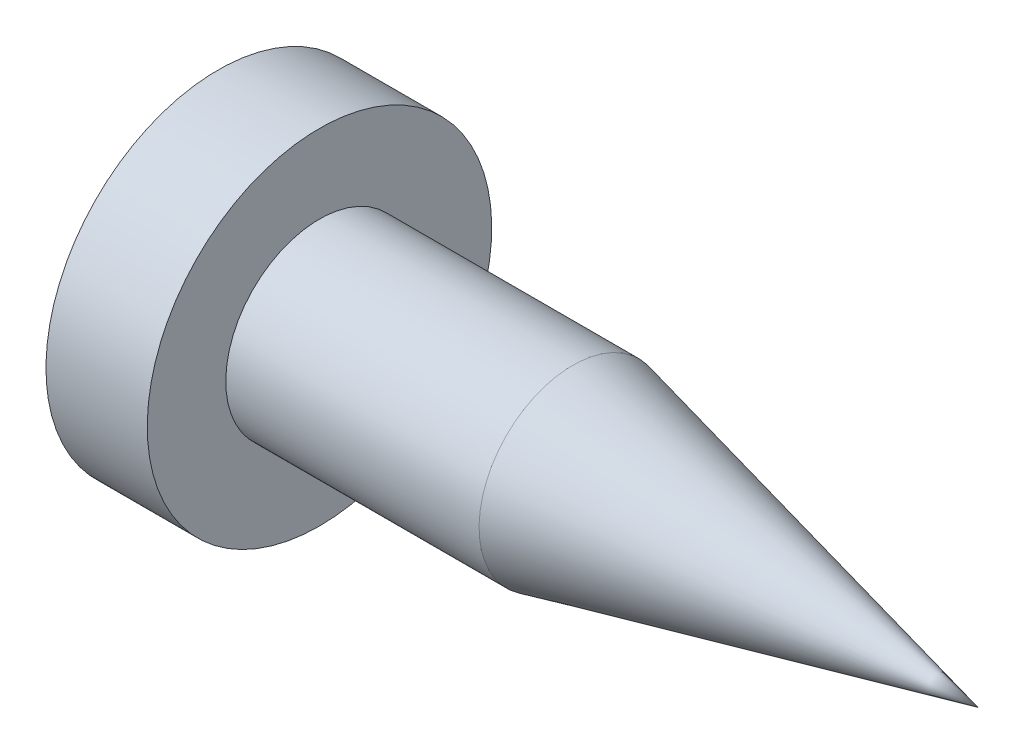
ISO-10303-21;
HEADER;
FILE_DESCRIPTION(('STEP AP214'),'2;1');
FILE_NAME('part.step','',(''),(''),'','','');
FILE_SCHEMA(('AUTOMOTIVE_DESIGN { 1 0 10303 214 1 1 1 1 }'));
ENDSEC;
DATA;
#1=APPLICATION_CONTEXT('core data for automotive mechanical design processes');
#2=APPLICATION_PROTOCOL_DEFINITION('international standard','automotive_design',2000,#1);
#3=PRODUCT_CONTEXT('',#1,'mechanical');
#4=PRODUCT('Part','Part','',(#3));
#5=PRODUCT_RELATED_PRODUCT_CATEGORY('part','',(#4));
#6=PRODUCT_DEFINITION_FORMATION('','',#4);
#7=PRODUCT_DEFINITION_CONTEXT('part definition',#1,'design');
#8=PRODUCT_DEFINITION('design','',#6,#7);
#9=PRODUCT_DEFINITION_SHAPE('','',#8);
#10=(LENGTH_UNIT() NAMED_UNIT(*) SI_UNIT(.MILLI.,.METRE.));
#11=(NAMED_UNIT(*) PLANE_ANGLE_UNIT() SI_UNIT($,.RADIAN.));
#12=(NAMED_UNIT(*) SI_UNIT($,.STERADIAN.) SOLID_ANGLE_UNIT());
#13=UNCERTAINTY_MEASURE_WITH_UNIT(LENGTH_MEASURE(1.E-05),#10,'distance_accuracy_value','');
#14=(GEOMETRIC_REPRESENTATION_CONTEXT(3) GLOBAL_UNCERTAINTY_ASSIGNED_CONTEXT((#13)) GLOBAL_UNIT_ASSIGNED_CONTEXT((#10,
#11,#12)) REPRESENTATION_CONTEXT('',''));
#15=CARTESIAN_POINT('',(0.,0.,0.));
#16=DIRECTION('',(0.,0.,1.));
#17=DIRECTION('',(1.,0.,0.));
#18=AXIS2_PLACEMENT_3D('',#15,#16,#17);
#19=CARTESIAN_POINT('',(13.,0.,0.));
#20=DIRECTION('',(-1.,0.,0.));
#21=DIRECTION('',(0.,-1.,0.));
#22=AXIS2_PLACEMENT_3D('',#19,#20,#21);
#23=CONICAL_SURFACE('',#22,0.,0.227255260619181);
#24=CARTESIAN_POINT('',(5.,0.,0.));
#25=DIRECTION('',(-1.,0.,0.));
#26=DIRECTION('',(0.,-1.,0.));
#27=AXIS2_PLACEMENT_3D('',#24,#25,#26);
#28=CIRCLE('',#27,1.85);
#29=CARTESIAN_POINT('',(5.,-1.85,0.));
#30=VERTEX_POINT('',#29);
#31=EDGE_CURVE('E241',#30,#30,#28,.T.);
#32=ORIENTED_EDGE('',*,*,#31,.F.);
#33=EDGE_LOOP('',(#32));
#34=FACE_BOUND('',#33,.T.);
#35=CARTESIAN_POINT('',(13.,0.,0.));
#36=VERTEX_POINT('',#35);
#37=VERTEX_LOOP('',#36);
#38=FACE_BOUND('',#37,.T.);
#39=ADVANCED_FACE('F30',(#34,#38),#23,.T.);
#40=CARTESIAN_POINT('',(-2.,0.,0.));
#41=DIRECTION('',(-1.,0.,0.));
#42=DIRECTION('',(0.,-1.,0.));
#43=AXIS2_PLACEMENT_3D('',#40,#41,#42);
#44=CYLINDRICAL_SURFACE('',#43,1.85);
#45=CARTESIAN_POINT('',(0.,0.,0.));
#46=DIRECTION('',(-1.,0.,0.));
#47=DIRECTION('',(0.,-1.,0.));
#48=AXIS2_PLACEMENT_3D('',#45,#46,#47);
#49=CIRCLE('',#48,1.84999999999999);
#50=CARTESIAN_POINT('',(0.,-1.84999999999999,0.));
#51=VERTEX_POINT('',#50);
#52=EDGE_CURVE('E238',#51,#51,#49,.T.);
#53=ORIENTED_EDGE('',*,*,#52,.F.);
#54=EDGE_LOOP('',(#53));
#55=FACE_BOUND('',#54,.T.);
#56=ORIENTED_EDGE('',*,*,#31,.T.);
#57=EDGE_LOOP('',(#56));
#58=FACE_BOUND('',#57,.T.);
#59=ADVANCED_FACE('F280',(#55,#58),#44,.T.);
#60=CARTESIAN_POINT('',(0.,3.4,0.));
#61=DIRECTION('',(-1.,0.,0.));
#62=DIRECTION('',(0.,-1.,0.));
#63=AXIS2_PLACEMENT_3D('',#60,#61,#62);
#64=PLANE('',#63);
#65=CARTESIAN_POINT('',(0.,0.,0.));
#66=DIRECTION('',(-1.,0.,0.));
#67=DIRECTION('',(0.,-1.,0.));
#68=AXIS2_PLACEMENT_3D('',#65,#66,#67);
#69=CIRCLE('',#68,3.4);
#70=CARTESIAN_POINT('',(0.,-3.4,0.));
#71=VERTEX_POINT('',#70);
#72=EDGE_CURVE('E235',#71,#71,#69,.T.);
#73=ORIENTED_EDGE('',*,*,#72,.F.);
#74=EDGE_LOOP('',(#73));
#75=FACE_BOUND('',#74,.T.);
#76=ORIENTED_EDGE('',*,*,#52,.T.);
#77=EDGE_LOOP('',(#76));
#78=FACE_BOUND('',#77,.T.);
#79=ADVANCED_FACE('F285',(#75,#78),#64,.F.);
#80=CARTESIAN_POINT('',(-2.,0.,0.));
#81=DIRECTION('',(-1.,0.,0.));
#82=DIRECTION('',(0.,-1.,0.));
#83=AXIS2_PLACEMENT_3D('',#80,#81,#82);
#84=CYLINDRICAL_SURFACE('',#83,3.4);
#85=CARTESIAN_POINT('',(-2.,0.,0.));
#86=DIRECTION('',(-1.,0.,0.));
#87=DIRECTION('',(0.,-1.,0.));
#88=AXIS2_PLACEMENT_3D('',#85,#86,#87);
#89=CIRCLE('',#88,3.4);
#90=CARTESIAN_POINT('',(-2.,-3.4,0.));
#91=VERTEX_POINT('',#90);
#92=EDGE_CURVE('E205',#91,#91,#89,.T.);
#93=ORIENTED_EDGE('',*,*,#92,.F.);
#94=EDGE_LOOP('',(#93));
#95=FACE_BOUND('',#94,.T.);
#96=ORIENTED_EDGE('',*,*,#72,.T.);
#97=EDGE_LOOP('',(#96));
#98=FACE_BOUND('',#97,.T.);
#99=ADVANCED_FACE('F277',(#95,#98),#84,.T.);
#100=CARTESIAN_POINT('',(3.27999999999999,0.,0.));
#101=DIRECTION('',(0.,0.,1.));
#102=DIRECTION('',(1.,0.,0.));
#103=AXIS2_PLACEMENT_3D('',#100,#101,#102);
#104=SPHERICAL_SURFACE('',#103,6.27999999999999);
#105=CARTESIAN_POINT('',(3.27999999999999,0.5,0.));
#106=DIRECTION('',(0.,1.,0.));
#107=DIRECTION('',(0.,0.,1.));
#108=AXIS2_PLACEMENT_3D('',#105,#106,#107);
#109=CIRCLE('',#108,6.26006389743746);
#110=CARTESIAN_POINT('',(-2.9408038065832,0.5,0.700000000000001));
#111=VERTEX_POINT('',#110);
#112=CARTESIAN_POINT('',(-2.65198111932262,0.5,2.));
#113=VERTEX_POINT('',#112);
#114=EDGE_CURVE('E37',#111,#113,#109,.T.);
#115=ORIENTED_EDGE('',*,*,#114,.T.);
#116=CARTESIAN_POINT('',(3.27999999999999,0.,2.));
#117=DIRECTION('',(0.,0.,1.));
#118=DIRECTION('',(1.,0.,0.));
#119=AXIS2_PLACEMENT_3D('',#116,#117,#118);
#120=CIRCLE('',#119,5.95301604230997);
#121=CARTESIAN_POINT('',(-2.65198111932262,-0.5,2.));
#122=VERTEX_POINT('',#121);
#123=EDGE_CURVE('E11',#113,#122,#120,.T.);
#124=ORIENTED_EDGE('',*,*,#123,.T.);
#125=CARTESIAN_POINT('',(3.27999999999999,-0.5,0.));
#126=DIRECTION('',(0.,-1.,0.));
#127=DIRECTION('',(0.,0.,-1.));
#128=AXIS2_PLACEMENT_3D('',#125,#126,#127);
#129=CIRCLE('',#128,6.26006389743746);
#130=CARTESIAN_POINT('',(-2.9408038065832,-0.5,0.700000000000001));
#131=VERTEX_POINT('',#130);
#132=EDGE_CURVE('E145',#122,#131,#129,.T.);
#133=ORIENTED_EDGE('',*,*,#132,.T.);
#134=CARTESIAN_POINT('',(-2.94078129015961,-0.500000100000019,0.700200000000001));
#135=CARTESIAN_POINT('',(-2.94203820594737,-0.499979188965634,0.689050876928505));
#136=CARTESIAN_POINT('',(-2.9431890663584,-0.500909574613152,0.677889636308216));
#137=CARTESIAN_POINT('',(-2.94524990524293,-0.504614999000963,0.65585978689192));
#138=CARTESIAN_POINT('',(-2.94615998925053,-0.507389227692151,0.644991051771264));
#139=CARTESIAN_POINT('',(-2.94771224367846,-0.51472725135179,0.623844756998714));
#140=CARTESIAN_POINT('',(-2.94835421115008,-0.519292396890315,0.613567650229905));
#141=CARTESIAN_POINT('',(-2.94935005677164,-0.530083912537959,0.593914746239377));
#142=CARTESIAN_POINT('',(-2.94970402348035,-0.536309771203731,0.584538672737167));
#143=CARTESIAN_POINT('',(-2.95011190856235,-0.55020035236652,0.567017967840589));
#144=CARTESIAN_POINT('',(-2.95016785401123,-0.557854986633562,0.558865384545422));
#145=CARTESIAN_POINT('',(-2.94998344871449,-0.574413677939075,0.543947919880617));
#146=CARTESIAN_POINT('',(-2.94974305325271,-0.583317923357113,0.537183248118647));
#147=CARTESIAN_POINT('',(-2.94897440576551,-0.602089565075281,0.525251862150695));
#148=CARTESIAN_POINT('',(-2.94844701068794,-0.611954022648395,0.520080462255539));
#149=CARTESIAN_POINT('',(-2.94712049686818,-0.632386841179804,0.511449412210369));
#150=CARTESIAN_POINT('',(-2.94632148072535,-0.642954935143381,0.507989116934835));
#151=CARTESIAN_POINT('',(-2.94474575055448,-0.66134277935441,0.503614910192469));
#152=CARTESIAN_POINT('',(-2.94403058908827,-0.669064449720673,0.502252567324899));
#153=CARTESIAN_POINT('',(-2.94248778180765,-0.684591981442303,0.500441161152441));
#154=CARTESIAN_POINT('',(-2.94166029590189,-0.692397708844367,0.499990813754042));
#155=CARTESIAN_POINT('',(-2.94078129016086,-0.7001999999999,0.500000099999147));
#156=B_SPLINE_CURVE_WITH_KNOTS('',3,(#134,#135,#136,#137,#138,#139,#140,#141,#142,#143,#144,
#145,#146,#147,#148,#149,#150,#151,#152,#153,#154,#155),.UNSPECIFIED.,.F.,.F.,(4,2,2,2,2,2,2,2,
2,2,4),(0.,0.033618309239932,0.0672218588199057,0.1008507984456,0.13446939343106,
0.167859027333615,0.201253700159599,0.234549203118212,0.267832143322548,0.291401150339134,
0.314936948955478),.UNSPECIFIED.);
#157=CARTESIAN_POINT('',(-2.9408038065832,-0.700000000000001,0.5));
#158=VERTEX_POINT('',#157);
#159=EDGE_CURVE('E245',#131,#158,#156,.T.);
#160=ORIENTED_EDGE('',*,*,#159,.T.);
#161=CARTESIAN_POINT('',(3.27999999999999,0.,0.5));
#162=DIRECTION('',(0.,0.,1.));
#163=DIRECTION('',(1.,0.,0.));
#164=AXIS2_PLACEMENT_3D('',#161,#162,#163);
#165=CIRCLE('',#164,6.26006389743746);
#166=CARTESIAN_POINT('',(-2.65198111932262,-2.,0.5));
#167=VERTEX_POINT('',#166);
#168=EDGE_CURVE('E253',#158,#167,#165,.T.);
#169=ORIENTED_EDGE('',*,*,#168,.T.);
#170=CARTESIAN_POINT('',(3.27999999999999,-2.,0.));
#171=DIRECTION('',(0.,-1.,0.));
#172=DIRECTION('',(0.,0.,-1.));
#173=AXIS2_PLACEMENT_3D('',#170,#171,#172);
#174=CIRCLE('',#173,5.95301604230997);
#175=CARTESIAN_POINT('',(-2.65198111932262,-2.,-0.5));
#176=VERTEX_POINT('',#175);
#177=EDGE_CURVE('E522',#167,#176,#174,.T.);
#178=ORIENTED_EDGE('',*,*,#177,.T.);
#179=CARTESIAN_POINT('',(3.27999999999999,0.,-0.5));
#180=DIRECTION('',(0.,0.,-1.));
#181=DIRECTION('',(-1.,0.,0.));
#182=AXIS2_PLACEMENT_3D('',#179,#180,#181);
#183=CIRCLE('',#182,6.26006389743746);
#184=CARTESIAN_POINT('',(-2.9408038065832,-0.700000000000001,-0.5));
#185=VERTEX_POINT('',#184);
#186=EDGE_CURVE('E504',#176,#185,#183,.T.);
#187=ORIENTED_EDGE('',*,*,#186,.T.);
#188=CARTESIAN_POINT('',(-2.94078129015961,-0.700200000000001,-0.500000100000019));
#189=CARTESIAN_POINT('',(-2.94203820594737,-0.689050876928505,-0.499979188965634));
#190=CARTESIAN_POINT('',(-2.9431890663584,-0.677889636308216,-0.500909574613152));
#191=CARTESIAN_POINT('',(-2.94524990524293,-0.65585978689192,-0.504614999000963));
#192=CARTESIAN_POINT('',(-2.94615998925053,-0.644991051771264,-0.507389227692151));
#193=CARTESIAN_POINT('',(-2.94771224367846,-0.623844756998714,-0.51472725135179));
#194=CARTESIAN_POINT('',(-2.94835421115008,-0.613567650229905,-0.519292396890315));
#195=CARTESIAN_POINT('',(-2.94935005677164,-0.593914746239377,-0.530083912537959));
#196=CARTESIAN_POINT('',(-2.94970402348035,-0.584538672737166,-0.536309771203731));
#197=CARTESIAN_POINT('',(-2.95011190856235,-0.567017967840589,-0.55020035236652));
#198=CARTESIAN_POINT('',(-2.95016785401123,-0.558865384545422,-0.557854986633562));
#199=CARTESIAN_POINT('',(-2.94998344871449,-0.543947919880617,-0.574413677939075));
#200=CARTESIAN_POINT('',(-2.94974305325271,-0.537183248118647,-0.583317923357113));
#201=CARTESIAN_POINT('',(-2.9489744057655,-0.525251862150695,-0.602089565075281));
#202=CARTESIAN_POINT('',(-2.94844701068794,-0.520080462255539,-0.611954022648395));
#203=CARTESIAN_POINT('',(-2.94712049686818,-0.511449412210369,-0.632386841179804));
#204=CARTESIAN_POINT('',(-2.94632148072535,-0.507989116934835,-0.642954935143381));
#205=CARTESIAN_POINT('',(-2.94474575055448,-0.503614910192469,-0.66134277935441));
#206=CARTESIAN_POINT('',(-2.94403058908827,-0.502252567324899,-0.669064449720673));
#207=CARTESIAN_POINT('',(-2.94248778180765,-0.500441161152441,-0.684591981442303));
#208=CARTESIAN_POINT('',(-2.94166029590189,-0.499990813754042,-0.692397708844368));
#209=CARTESIAN_POINT('',(-2.94078129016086,-0.500000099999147,-0.7001999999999));
#210=B_SPLINE_CURVE_WITH_KNOTS('',3,(#188,#189,#190,#191,#192,#193,#194,#195,#196,#197,#198,
#199,#200,#201,#202,#203,#204,#205,#206,#207,#208,#209),.UNSPECIFIED.,.F.,.F.,(4,2,2,2,2,2,2,2,
2,2,4),(0.,0.0336183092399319,0.0672218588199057,0.1008507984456,0.13446939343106,
0.167859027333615,0.201253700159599,0.234549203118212,0.267832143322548,0.291401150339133,
0.314936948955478),.UNSPECIFIED.);
#211=CARTESIAN_POINT('',(-2.9408038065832,-0.5,-0.700000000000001));
#212=VERTEX_POINT('',#211);
#213=EDGE_CURVE('E496',#185,#212,#210,.T.);
#214=ORIENTED_EDGE('',*,*,#213,.T.);
#215=CARTESIAN_POINT('',(3.27999999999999,-0.5,0.));
#216=DIRECTION('',(0.,-1.,0.));
#217=DIRECTION('',(0.,0.,-1.));
#218=AXIS2_PLACEMENT_3D('',#215,#216,#217);
#219=CIRCLE('',#218,6.26006389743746);
#220=CARTESIAN_POINT('',(-2.65198111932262,-0.5,-2.));
#221=VERTEX_POINT('',#220);
#222=EDGE_CURVE('E503',#212,#221,#219,.T.);
#223=ORIENTED_EDGE('',*,*,#222,.T.);
#224=CARTESIAN_POINT('',(3.27999999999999,0.,-2.));
#225=DIRECTION('',(0.,0.,-1.));
#226=DIRECTION('',(-1.,0.,0.));
#227=AXIS2_PLACEMENT_3D('',#224,#225,#226);
#228=CIRCLE('',#227,5.95301604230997);
#229=CARTESIAN_POINT('',(-2.65198111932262,0.5,-2.));
#230=VERTEX_POINT('',#229);
#231=EDGE_CURVE('E506',#221,#230,#228,.T.);
#232=ORIENTED_EDGE('',*,*,#231,.T.);
#233=CARTESIAN_POINT('',(3.27999999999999,0.5,0.));
#234=DIRECTION('',(0.,1.,0.));
#235=DIRECTION('',(0.,0.,1.));
#236=AXIS2_PLACEMENT_3D('',#233,#234,#235);
#237=CIRCLE('',#236,6.26006389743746);
#238=CARTESIAN_POINT('',(-2.9408038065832,0.5,-0.700000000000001));
#239=VERTEX_POINT('',#238);
#240=EDGE_CURVE('E491',#230,#239,#237,.T.);
#241=ORIENTED_EDGE('',*,*,#240,.T.);
#242=CARTESIAN_POINT('',(-2.94078129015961,0.500000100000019,-0.700200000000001));
#243=CARTESIAN_POINT('',(-2.94203820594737,0.499979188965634,-0.689050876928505));
#244=CARTESIAN_POINT('',(-2.9431890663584,0.500909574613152,-0.677889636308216));
#245=CARTESIAN_POINT('',(-2.94524990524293,0.504614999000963,-0.65585978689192));
#246=CARTESIAN_POINT('',(-2.94615998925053,0.507389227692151,-0.644991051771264));
#247=CARTESIAN_POINT('',(-2.94771224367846,0.51472725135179,-0.623844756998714));
#248=CARTESIAN_POINT('',(-2.94835421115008,0.519292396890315,-0.613567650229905));
#249=CARTESIAN_POINT('',(-2.94935005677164,0.530083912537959,-0.593914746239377));
#250=CARTESIAN_POINT('',(-2.94970402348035,0.536309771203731,-0.584538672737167));
#251=CARTESIAN_POINT('',(-2.95011190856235,0.55020035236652,-0.567017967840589));
#252=CARTESIAN_POINT('',(-2.95016785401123,0.557854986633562,-0.558865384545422));
#253=CARTESIAN_POINT('',(-2.94998344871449,0.574413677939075,-0.543947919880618));
#254=CARTESIAN_POINT('',(-2.94974305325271,0.583317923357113,-0.537183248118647));
#255=CARTESIAN_POINT('',(-2.9489744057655,0.602089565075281,-0.525251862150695));
#256=CARTESIAN_POINT('',(-2.94844701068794,0.611954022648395,-0.520080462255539));
#257=CARTESIAN_POINT('',(-2.94712049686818,0.632386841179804,-0.511449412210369));
#258=CARTESIAN_POINT('',(-2.94632148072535,0.642954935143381,-0.507989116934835));
#259=CARTESIAN_POINT('',(-2.94474575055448,0.66134277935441,-0.503614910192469));
#260=CARTESIAN_POINT('',(-2.94403058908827,0.669064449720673,-0.502252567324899));
#261=CARTESIAN_POINT('',(-2.94248778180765,0.684591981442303,-0.500441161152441));
#262=CARTESIAN_POINT('',(-2.94166029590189,0.692397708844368,-0.499990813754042));
#263=CARTESIAN_POINT('',(-2.94078129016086,0.7001999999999,-0.500000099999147));
#264=B_SPLINE_CURVE_WITH_KNOTS('',3,(#242,#243,#244,#245,#246,#247,#248,#249,#250,#251,#252,
#253,#254,#255,#256,#257,#258,#259,#260,#261,#262,#263),.UNSPECIFIED.,.F.,.F.,(4,2,2,2,2,2,2,2,
2,2,4),(0.,0.0336183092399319,0.0672218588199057,0.1008507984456,0.13446939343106,
0.167859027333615,0.201253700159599,0.234549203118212,0.267832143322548,0.291401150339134,
0.314936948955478),.UNSPECIFIED.);
#265=CARTESIAN_POINT('',(-2.9408038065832,0.700000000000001,-0.5));
#266=VERTEX_POINT('',#265);
#267=EDGE_CURVE('E484',#239,#266,#264,.T.);
#268=ORIENTED_EDGE('',*,*,#267,.T.);
#269=CARTESIAN_POINT('',(3.27999999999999,0.,-0.5));
#270=DIRECTION('',(0.,0.,-1.));
#271=DIRECTION('',(-1.,0.,0.));
#272=AXIS2_PLACEMENT_3D('',#269,#270,#271);
#273=CIRCLE('',#272,6.26006389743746);
#274=CARTESIAN_POINT('',(-2.65198111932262,2.,-0.5));
#275=VERTEX_POINT('',#274);
#276=EDGE_CURVE('E483',#266,#275,#273,.T.);
#277=ORIENTED_EDGE('',*,*,#276,.T.);
#278=CARTESIAN_POINT('',(3.27999999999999,2.,0.));
#279=DIRECTION('',(0.,1.,0.));
#280=DIRECTION('',(0.,0.,1.));
#281=AXIS2_PLACEMENT_3D('',#278,#279,#280);
#282=CIRCLE('',#281,5.95301604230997);
#283=CARTESIAN_POINT('',(-2.65198111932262,2.,0.5));
#284=VERTEX_POINT('',#283);
#285=EDGE_CURVE('E479',#275,#284,#282,.T.);
#286=ORIENTED_EDGE('',*,*,#285,.T.);
#287=CARTESIAN_POINT('',(3.27999999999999,0.,0.5));
#288=DIRECTION('',(0.,0.,1.));
#289=DIRECTION('',(1.,0.,0.));
#290=AXIS2_PLACEMENT_3D('',#287,#288,#289);
#291=CIRCLE('',#290,6.26006389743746);
#292=CARTESIAN_POINT('',(-2.9408038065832,0.700000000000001,0.5));
#293=VERTEX_POINT('',#292);
#294=EDGE_CURVE('E468',#284,#293,#291,.T.);
#295=ORIENTED_EDGE('',*,*,#294,.T.);
#296=CARTESIAN_POINT('',(-2.94078129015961,0.700200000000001,0.500000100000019));
#297=CARTESIAN_POINT('',(-2.94203820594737,0.689050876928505,0.499979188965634));
#298=CARTESIAN_POINT('',(-2.9431890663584,0.677889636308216,0.500909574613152));
#299=CARTESIAN_POINT('',(-2.94524990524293,0.65585978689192,0.504614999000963));
#300=CARTESIAN_POINT('',(-2.94615998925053,0.644991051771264,0.507389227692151));
#301=CARTESIAN_POINT('',(-2.94771224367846,0.623844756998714,0.51472725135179));
#302=CARTESIAN_POINT('',(-2.94835421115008,0.613567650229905,0.519292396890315));
#303=CARTESIAN_POINT('',(-2.94935005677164,0.593914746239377,0.530083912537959));
#304=CARTESIAN_POINT('',(-2.94970402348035,0.584538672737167,0.536309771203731));
#305=CARTESIAN_POINT('',(-2.95011190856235,0.567017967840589,0.55020035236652));
#306=CARTESIAN_POINT('',(-2.95016785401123,0.558865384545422,0.557854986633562));
#307=CARTESIAN_POINT('',(-2.94998344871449,0.543947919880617,0.574413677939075));
#308=CARTESIAN_POINT('',(-2.94974305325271,0.537183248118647,0.583317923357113));
#309=CARTESIAN_POINT('',(-2.9489744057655,0.525251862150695,0.602089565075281));
#310=CARTESIAN_POINT('',(-2.94844701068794,0.520080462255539,0.611954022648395));
#311=CARTESIAN_POINT('',(-2.94712049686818,0.511449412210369,0.632386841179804));
#312=CARTESIAN_POINT('',(-2.94632148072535,0.507989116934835,0.642954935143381));
#313=CARTESIAN_POINT('',(-2.94474575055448,0.503614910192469,0.66134277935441));
#314=CARTESIAN_POINT('',(-2.94403058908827,0.502252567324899,0.669064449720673));
#315=CARTESIAN_POINT('',(-2.94248778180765,0.500441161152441,0.684591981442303));
#316=CARTESIAN_POINT('',(-2.94166029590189,0.499990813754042,0.692397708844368));
#317=CARTESIAN_POINT('',(-2.94078129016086,0.500000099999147,0.7001999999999));
#318=B_SPLINE_CURVE_WITH_KNOTS('',3,(#296,#297,#298,#299,#300,#301,#302,#303,#304,#305,#306,
#307,#308,#309,#310,#311,#312,#313,#314,#315,#316,#317),.UNSPECIFIED.,.F.,.F.,(4,2,2,2,2,2,2,2,
2,2,4),(0.,0.0336183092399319,0.0672218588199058,0.1008507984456,0.13446939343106,
0.167859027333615,0.201253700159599,0.234549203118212,0.267832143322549,0.291401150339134,
0.314936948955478),.UNSPECIFIED.);
#319=EDGE_CURVE('E462',#293,#111,#318,.T.);
#320=ORIENTED_EDGE('',*,*,#319,.T.);
#321=EDGE_LOOP('',(#115,#124,#133,#160,#169,#178,#187,#214,#223,#232,#241,#268,#277,#286,#295,#320));
#322=FACE_BOUND('',#321,.T.);
#323=ORIENTED_EDGE('',*,*,#92,.T.);
#324=EDGE_LOOP('',(#323));
#325=FACE_BOUND('',#324,.T.);
#326=ADVANCED_FACE('F255',(#322,#325),#104,.T.);
#327=CARTESIAN_POINT('',(-11.,-0.5,2.));
#328=DIRECTION('',(0.,0.,1.));
#329=DIRECTION('',(1.,0.,0.));
#330=AXIS2_PLACEMENT_3D('',#327,#328,#329);
#331=PLANE('',#330);
#332=DIRECTION('',(1.,0.,0.));
#333=VECTOR('',#332,1.);
#334=CARTESIAN_POINT('',(-11.,0.5,2.));
#335=LINE('',#334,#333);
#336=CARTESIAN_POINT('',(-1.,0.5,2.));
#337=VERTEX_POINT('',#336);
#338=EDGE_CURVE('E163',#113,#337,#335,.T.);
#339=ORIENTED_EDGE('',*,*,#338,.T.);
#340=DIRECTION('',(0.,-1.,0.));
#341=VECTOR('',#340,1.);
#342=CARTESIAN_POINT('',(-1.,-0.5,2.));
#343=LINE('',#342,#341);
#344=CARTESIAN_POINT('',(-1.,-0.5,2.));
#345=VERTEX_POINT('',#344);
#346=EDGE_CURVE('E155',#337,#345,#343,.T.);
#347=ORIENTED_EDGE('',*,*,#346,.T.);
#348=DIRECTION('',(1.,0.,0.));
#349=VECTOR('',#348,1.);
#350=CARTESIAN_POINT('',(-11.,-0.5,2.));
#351=LINE('',#350,#349);
#352=EDGE_CURVE('E140',#122,#345,#351,.T.);
#353=ORIENTED_EDGE('',*,*,#352,.F.);
#354=ORIENTED_EDGE('',*,*,#123,.F.);
#355=EDGE_LOOP('',(#339,#347,#353,#354));
#356=FACE_BOUND('',#355,.T.);
#357=ADVANCED_FACE('F161',(#356),#331,.F.);
#358=CARTESIAN_POINT('',(-11.,0.5,2.));
#359=DIRECTION('',(0.,1.,0.));
#360=DIRECTION('',(0.,0.,1.));
#361=AXIS2_PLACEMENT_3D('',#358,#359,#360);
#362=PLANE('',#361);
#363=DIRECTION('',(1.,0.,0.));
#364=VECTOR('',#363,1.);
#365=CARTESIAN_POINT('',(-11.,0.5,0.700000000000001));
#366=LINE('',#365,#364);
#367=CARTESIAN_POINT('',(-1.,0.5,0.700000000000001));
#368=VERTEX_POINT('',#367);
#369=EDGE_CURVE('E206',#111,#368,#366,.T.);
#370=ORIENTED_EDGE('',*,*,#369,.T.);
#371=DIRECTION('',(0.,0.,1.));
#372=VECTOR('',#371,1.);
#373=CARTESIAN_POINT('',(-1.,0.5,2.));
#374=LINE('',#373,#372);
#375=EDGE_CURVE('E148',#368,#337,#374,.T.);
#376=ORIENTED_EDGE('',*,*,#375,.T.);
#377=ORIENTED_EDGE('',*,*,#338,.F.);
#378=ORIENTED_EDGE('',*,*,#114,.F.);
#379=EDGE_LOOP('',(#370,#376,#377,#378));
#380=FACE_BOUND('',#379,.T.);
#381=ADVANCED_FACE('F269',(#380),#362,.F.);
#382=CARTESIAN_POINT('',(-11.,0.7,0.7));
#383=DIRECTION('',(1.,0.,0.));
#384=DIRECTION('',(0.,0.,-1.));
#385=AXIS2_PLACEMENT_3D('',#382,#383,#384);
#386=CYLINDRICAL_SURFACE('',#385,0.2);
#387=DIRECTION('',(1.,0.,0.));
#388=VECTOR('',#387,1.);
#389=CARTESIAN_POINT('',(-11.,0.700000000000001,0.5));
#390=LINE('',#389,#388);
#391=CARTESIAN_POINT('',(-1.,0.700000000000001,0.5));
#392=VERTEX_POINT('',#391);
#393=EDGE_CURVE('E208',#293,#392,#390,.T.);
#394=ORIENTED_EDGE('',*,*,#393,.T.);
#395=CARTESIAN_POINT('',(-1.,0.7,0.7));
#396=DIRECTION('',(-1.,0.,0.));
#397=DIRECTION('',(0.,0.,1.));
#398=AXIS2_PLACEMENT_3D('',#395,#396,#397);
#399=CIRCLE('',#398,0.2);
#400=EDGE_CURVE('E200',#392,#368,#399,.T.);
#401=ORIENTED_EDGE('',*,*,#400,.T.);
#402=ORIENTED_EDGE('',*,*,#369,.F.);
#403=ORIENTED_EDGE('',*,*,#319,.F.);
#404=EDGE_LOOP('',(#394,#401,#402,#403));
#405=FACE_BOUND('',#404,.T.);
#406=ADVANCED_FACE('F274',(#405),#386,.T.);
#407=CARTESIAN_POINT('',(-11.,0.700000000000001,0.5));
#408=DIRECTION('',(0.,0.,1.));
#409=DIRECTION('',(1.,0.,0.));
#410=AXIS2_PLACEMENT_3D('',#407,#408,#409);
#411=PLANE('',#410);
#412=DIRECTION('',(1.,0.,0.));
#413=VECTOR('',#412,1.);
#414=CARTESIAN_POINT('',(-11.,2.,0.5));
#415=LINE('',#414,#413);
#416=CARTESIAN_POINT('',(-1.,2.,0.5));
#417=VERTEX_POINT('',#416);
#418=EDGE_CURVE('E210',#284,#417,#415,.T.);
#419=ORIENTED_EDGE('',*,*,#418,.T.);
#420=DIRECTION('',(0.,-1.,0.));
#421=VECTOR('',#420,1.);
#422=CARTESIAN_POINT('',(-1.,0.700000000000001,0.5));
#423=LINE('',#422,#421);
#424=EDGE_CURVE('E197',#417,#392,#423,.T.);
#425=ORIENTED_EDGE('',*,*,#424,.T.);
#426=ORIENTED_EDGE('',*,*,#393,.F.);
#427=ORIENTED_EDGE('',*,*,#294,.F.);
#428=EDGE_LOOP('',(#419,#425,#426,#427));
#429=FACE_BOUND('',#428,.T.);
#430=ADVANCED_FACE('F329',(#429),#411,.F.);
#431=CARTESIAN_POINT('',(-11.,2.,0.5));
#432=DIRECTION('',(0.,1.,0.));
#433=DIRECTION('',(0.,0.,1.));
#434=AXIS2_PLACEMENT_3D('',#431,#432,#433);
#435=PLANE('',#434);
#436=DIRECTION('',(1.,0.,0.));
#437=VECTOR('',#436,1.);
#438=CARTESIAN_POINT('',(-11.,2.,-0.5));
#439=LINE('',#438,#437);
#440=CARTESIAN_POINT('',(-1.,2.,-0.5));
#441=VERTEX_POINT('',#440);
#442=EDGE_CURVE('E212',#275,#441,#439,.T.);
#443=ORIENTED_EDGE('',*,*,#442,.T.);
#444=DIRECTION('',(0.,0.,1.));
#445=VECTOR('',#444,1.);
#446=CARTESIAN_POINT('',(-1.,2.,0.5));
#447=LINE('',#446,#445);
#448=EDGE_CURVE('E194',#441,#417,#447,.T.);
#449=ORIENTED_EDGE('',*,*,#448,.T.);
#450=ORIENTED_EDGE('',*,*,#418,.F.);
#451=ORIENTED_EDGE('',*,*,#285,.F.);
#452=EDGE_LOOP('',(#443,#449,#450,#451));
#453=FACE_BOUND('',#452,.T.);
#454=ADVANCED_FACE('F339',(#453),#435,.F.);
#455=CARTESIAN_POINT('',(-11.,0.700000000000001,-0.5));
#456=DIRECTION('',(0.,0.,-1.));
#457=DIRECTION('',(-1.,0.,0.));
#458=AXIS2_PLACEMENT_3D('',#455,#456,#457);
#459=PLANE('',#458);
#460=DIRECTION('',(1.,0.,0.));
#461=VECTOR('',#460,1.);
#462=CARTESIAN_POINT('',(-11.,0.700000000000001,-0.5));
#463=LINE('',#462,#461);
#464=CARTESIAN_POINT('',(-1.,0.700000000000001,-0.5));
#465=VERTEX_POINT('',#464);
#466=EDGE_CURVE('E214',#266,#465,#463,.T.);
#467=ORIENTED_EDGE('',*,*,#466,.T.);
#468=DIRECTION('',(0.,1.,0.));
#469=VECTOR('',#468,1.);
#470=CARTESIAN_POINT('',(-1.,0.700000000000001,-0.5));
#471=LINE('',#470,#469);
#472=EDGE_CURVE('E191',#465,#441,#471,.T.);
#473=ORIENTED_EDGE('',*,*,#472,.T.);
#474=ORIENTED_EDGE('',*,*,#442,.F.);
#475=ORIENTED_EDGE('',*,*,#276,.F.);
#476=EDGE_LOOP('',(#467,#473,#474,#475));
#477=FACE_BOUND('',#476,.T.);
#478=ADVANCED_FACE('F349',(#477),#459,.F.);
#479=CARTESIAN_POINT('',(-11.,0.7,-0.7));
#480=DIRECTION('',(1.,0.,0.));
#481=DIRECTION('',(0.,0.,-1.));
#482=AXIS2_PLACEMENT_3D('',#479,#480,#481);
#483=CYLINDRICAL_SURFACE('',#482,0.2);
#484=DIRECTION('',(1.,0.,0.));
#485=VECTOR('',#484,1.);
#486=CARTESIAN_POINT('',(-11.,0.5,-0.700000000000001));
#487=LINE('',#486,#485);
#488=CARTESIAN_POINT('',(-1.,0.5,-0.700000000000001));
#489=VERTEX_POINT('',#488);
#490=EDGE_CURVE('E216',#239,#489,#487,.T.);
#491=ORIENTED_EDGE('',*,*,#490,.T.);
#492=CARTESIAN_POINT('',(-1.,0.7,-0.7));
#493=DIRECTION('',(-1.,0.,0.));
#494=DIRECTION('',(0.,0.,1.));
#495=AXIS2_PLACEMENT_3D('',#492,#493,#494);
#496=CIRCLE('',#495,0.2);
#497=EDGE_CURVE('E188',#489,#465,#496,.T.);
#498=ORIENTED_EDGE('',*,*,#497,.T.);
#499=ORIENTED_EDGE('',*,*,#466,.F.);
#500=ORIENTED_EDGE('',*,*,#267,.F.);
#501=EDGE_LOOP('',(#491,#498,#499,#500));
#502=FACE_BOUND('',#501,.T.);
#503=ADVANCED_FACE('F359',(#502),#483,.T.);
#504=CARTESIAN_POINT('',(-11.,0.5,-0.700000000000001));
#505=DIRECTION('',(0.,1.,0.));
#506=DIRECTION('',(0.,0.,1.));
#507=AXIS2_PLACEMENT_3D('',#504,#505,#506);
#508=PLANE('',#507);
#509=DIRECTION('',(1.,0.,0.));
#510=VECTOR('',#509,1.);
#511=CARTESIAN_POINT('',(-11.,0.5,-2.));
#512=LINE('',#511,#510);
#513=CARTESIAN_POINT('',(-1.,0.5,-2.));
#514=VERTEX_POINT('',#513);
#515=EDGE_CURVE('E218',#230,#514,#512,.T.);
#516=ORIENTED_EDGE('',*,*,#515,.T.);
#517=DIRECTION('',(0.,0.,1.));
#518=VECTOR('',#517,1.);
#519=CARTESIAN_POINT('',(-1.,0.5,-0.700000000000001));
#520=LINE('',#519,#518);
#521=EDGE_CURVE('E185',#514,#489,#520,.T.);
#522=ORIENTED_EDGE('',*,*,#521,.T.);
#523=ORIENTED_EDGE('',*,*,#490,.F.);
#524=ORIENTED_EDGE('',*,*,#240,.F.);
#525=EDGE_LOOP('',(#516,#522,#523,#524));
#526=FACE_BOUND('',#525,.T.);
#527=ADVANCED_FACE('F369',(#526),#508,.F.);
#528=CARTESIAN_POINT('',(-11.,-0.5,-2.));
#529=DIRECTION('',(0.,0.,-1.));
#530=DIRECTION('',(-1.,0.,0.));
#531=AXIS2_PLACEMENT_3D('',#528,#529,#530);
#532=PLANE('',#531);
#533=DIRECTION('',(1.,0.,0.));
#534=VECTOR('',#533,1.);
#535=CARTESIAN_POINT('',(-11.,-0.5,-2.));
#536=LINE('',#535,#534);
#537=CARTESIAN_POINT('',(-1.,-0.5,-2.));
#538=VERTEX_POINT('',#537);
#539=EDGE_CURVE('E220',#221,#538,#536,.T.);
#540=ORIENTED_EDGE('',*,*,#539,.T.);
#541=DIRECTION('',(0.,1.,0.));
#542=VECTOR('',#541,1.);
#543=CARTESIAN_POINT('',(-1.,-0.5,-2.));
#544=LINE('',#543,#542);
#545=EDGE_CURVE('E182',#538,#514,#544,.T.);
#546=ORIENTED_EDGE('',*,*,#545,.T.);
#547=ORIENTED_EDGE('',*,*,#515,.F.);
#548=ORIENTED_EDGE('',*,*,#231,.F.);
#549=EDGE_LOOP('',(#540,#546,#547,#548));
#550=FACE_BOUND('',#549,.T.);
#551=ADVANCED_FACE('F379',(#550),#532,.F.);
#552=CARTESIAN_POINT('',(-11.,-0.5,-0.700000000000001));
#553=DIRECTION('',(0.,-1.,0.));
#554=DIRECTION('',(0.,0.,-1.));
#555=AXIS2_PLACEMENT_3D('',#552,#553,#554);
#556=PLANE('',#555);
#557=DIRECTION('',(1.,0.,0.));
#558=VECTOR('',#557,1.);
#559=CARTESIAN_POINT('',(-11.,-0.5,-0.700000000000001));
#560=LINE('',#559,#558);
#561=CARTESIAN_POINT('',(-1.,-0.5,-0.700000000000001));
#562=VERTEX_POINT('',#561);
#563=EDGE_CURVE('E222',#212,#562,#560,.T.);
#564=ORIENTED_EDGE('',*,*,#563,.T.);
#565=DIRECTION('',(0.,0.,-1.));
#566=VECTOR('',#565,1.);
#567=CARTESIAN_POINT('',(-1.,-0.5,-0.700000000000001));
#568=LINE('',#567,#566);
#569=EDGE_CURVE('E179',#562,#538,#568,.T.);
#570=ORIENTED_EDGE('',*,*,#569,.T.);
#571=ORIENTED_EDGE('',*,*,#539,.F.);
#572=ORIENTED_EDGE('',*,*,#222,.F.);
#573=EDGE_LOOP('',(#564,#570,#571,#572));
#574=FACE_BOUND('',#573,.T.);
#575=ADVANCED_FACE('F389',(#574),#556,.F.);
#576=CARTESIAN_POINT('',(-11.,-0.7,-0.7));
#577=DIRECTION('',(1.,0.,0.));
#578=DIRECTION('',(0.,0.,-1.));
#579=AXIS2_PLACEMENT_3D('',#576,#577,#578);
#580=CYLINDRICAL_SURFACE('',#579,0.2);
#581=DIRECTION('',(1.,0.,0.));
#582=VECTOR('',#581,1.);
#583=CARTESIAN_POINT('',(-11.,-0.700000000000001,-0.5));
#584=LINE('',#583,#582);
#585=CARTESIAN_POINT('',(-1.,-0.700000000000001,-0.5));
#586=VERTEX_POINT('',#585);
#587=EDGE_CURVE('E224',#185,#586,#584,.T.);
#588=ORIENTED_EDGE('',*,*,#587,.T.);
#589=CARTESIAN_POINT('',(-1.,-0.7,-0.7));
#590=DIRECTION('',(-1.,0.,0.));
#591=DIRECTION('',(0.,0.,1.));
#592=AXIS2_PLACEMENT_3D('',#589,#590,#591);
#593=CIRCLE('',#592,0.2);
#594=EDGE_CURVE('E176',#586,#562,#593,.T.);
#595=ORIENTED_EDGE('',*,*,#594,.T.);
#596=ORIENTED_EDGE('',*,*,#563,.F.);
#597=ORIENTED_EDGE('',*,*,#213,.F.);
#598=EDGE_LOOP('',(#588,#595,#596,#597));
#599=FACE_BOUND('',#598,.T.);
#600=ADVANCED_FACE('F399',(#599),#580,.T.);
#601=CARTESIAN_POINT('',(-11.,-2.,-0.5));
#602=DIRECTION('',(0.,0.,-1.));
#603=DIRECTION('',(-1.,0.,0.));
#604=AXIS2_PLACEMENT_3D('',#601,#602,#603);
#605=PLANE('',#604);
#606=DIRECTION('',(1.,0.,0.));
#607=VECTOR('',#606,1.);
#608=CARTESIAN_POINT('',(-11.,-2.,-0.5));
#609=LINE('',#608,#607);
#610=CARTESIAN_POINT('',(-1.,-2.,-0.5));
#611=VERTEX_POINT('',#610);
#612=EDGE_CURVE('E226',#176,#611,#609,.T.);
#613=ORIENTED_EDGE('',*,*,#612,.T.);
#614=DIRECTION('',(0.,1.,0.));
#615=VECTOR('',#614,1.);
#616=CARTESIAN_POINT('',(-1.,-2.,-0.5));
#617=LINE('',#616,#615);
#618=EDGE_CURVE('E173',#611,#586,#617,.T.);
#619=ORIENTED_EDGE('',*,*,#618,.T.);
#620=ORIENTED_EDGE('',*,*,#587,.F.);
#621=ORIENTED_EDGE('',*,*,#186,.F.);
#622=EDGE_LOOP('',(#613,#619,#620,#621));
#623=FACE_BOUND('',#622,.T.);
#624=ADVANCED_FACE('F409',(#623),#605,.F.);
#625=CARTESIAN_POINT('',(-11.,-2.,0.5));
#626=DIRECTION('',(0.,-1.,0.));
#627=DIRECTION('',(0.,0.,-1.));
#628=AXIS2_PLACEMENT_3D('',#625,#626,#627);
#629=PLANE('',#628);
#630=DIRECTION('',(1.,0.,0.));
#631=VECTOR('',#630,1.);
#632=CARTESIAN_POINT('',(-11.,-2.,0.5));
#633=LINE('',#632,#631);
#634=CARTESIAN_POINT('',(-1.,-2.,0.5));
#635=VERTEX_POINT('',#634);
#636=EDGE_CURVE('E228',#167,#635,#633,.T.);
#637=ORIENTED_EDGE('',*,*,#636,.T.);
#638=DIRECTION('',(0.,0.,-1.));
#639=VECTOR('',#638,1.);
#640=CARTESIAN_POINT('',(-1.,-2.,0.5));
#641=LINE('',#640,#639);
#642=EDGE_CURVE('E170',#635,#611,#641,.T.);
#643=ORIENTED_EDGE('',*,*,#642,.T.);
#644=ORIENTED_EDGE('',*,*,#612,.F.);
#645=ORIENTED_EDGE('',*,*,#177,.F.);
#646=EDGE_LOOP('',(#637,#643,#644,#645));
#647=FACE_BOUND('',#646,.T.);
#648=ADVANCED_FACE('F419',(#647),#629,.F.);
#649=CARTESIAN_POINT('',(-11.,-2.,0.5));
#650=DIRECTION('',(0.,0.,1.));
#651=DIRECTION('',(1.,0.,0.));
#652=AXIS2_PLACEMENT_3D('',#649,#650,#651);
#653=PLANE('',#652);
#654=DIRECTION('',(1.,0.,0.));
#655=VECTOR('',#654,1.);
#656=CARTESIAN_POINT('',(-11.,-0.700000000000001,0.5));
#657=LINE('',#656,#655);
#658=CARTESIAN_POINT('',(-1.,-0.700000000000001,0.5));
#659=VERTEX_POINT('',#658);
#660=EDGE_CURVE('E230',#158,#659,#657,.T.);
#661=ORIENTED_EDGE('',*,*,#660,.T.);
#662=DIRECTION('',(0.,-1.,0.));
#663=VECTOR('',#662,1.);
#664=CARTESIAN_POINT('',(-1.,-2.,0.5));
#665=LINE('',#664,#663);
#666=EDGE_CURVE('E167',#659,#635,#665,.T.);
#667=ORIENTED_EDGE('',*,*,#666,.T.);
#668=ORIENTED_EDGE('',*,*,#636,.F.);
#669=ORIENTED_EDGE('',*,*,#168,.F.);
#670=EDGE_LOOP('',(#661,#667,#668,#669));
#671=FACE_BOUND('',#670,.T.);
#672=ADVANCED_FACE('F264',(#671),#653,.F.);
#673=CARTESIAN_POINT('',(-11.,-0.7,0.7));
#674=DIRECTION('',(1.,0.,0.));
#675=DIRECTION('',(0.,0.,-1.));
#676=AXIS2_PLACEMENT_3D('',#673,#674,#675);
#677=CYLINDRICAL_SURFACE('',#676,0.2);
#678=DIRECTION('',(1.,0.,0.));
#679=VECTOR('',#678,1.);
#680=CARTESIAN_POINT('',(-11.,-0.5,0.700000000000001));
#681=LINE('',#680,#679);
#682=CARTESIAN_POINT('',(-1.,-0.5,0.700000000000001));
#683=VERTEX_POINT('',#682);
#684=EDGE_CURVE('E44',#131,#683,#681,.T.);
#685=ORIENTED_EDGE('',*,*,#684,.T.);
#686=CARTESIAN_POINT('',(-1.,-0.7,0.7));
#687=DIRECTION('',(-1.,0.,0.));
#688=DIRECTION('',(0.,0.,1.));
#689=AXIS2_PLACEMENT_3D('',#686,#687,#688);
#690=CIRCLE('',#689,0.2);
#691=EDGE_CURVE('E159',#683,#659,#690,.T.);
#692=ORIENTED_EDGE('',*,*,#691,.T.);
#693=ORIENTED_EDGE('',*,*,#660,.F.);
#694=ORIENTED_EDGE('',*,*,#159,.F.);
#695=EDGE_LOOP('',(#685,#692,#693,#694));
#696=FACE_BOUND('',#695,.T.);
#697=ADVANCED_FACE('F259',(#696),#677,.T.);
#698=CARTESIAN_POINT('',(-11.,-0.5,2.));
#699=DIRECTION('',(0.,-1.,0.));
#700=DIRECTION('',(0.,0.,-1.));
#701=AXIS2_PLACEMENT_3D('',#698,#699,#700);
#702=PLANE('',#701);
#703=ORIENTED_EDGE('',*,*,#352,.T.);
#704=DIRECTION('',(0.,0.,-1.));
#705=VECTOR('',#704,1.);
#706=CARTESIAN_POINT('',(-1.,-0.5,2.));
#707=LINE('',#706,#705);
#708=EDGE_CURVE('E143',#345,#683,#707,.T.);
#709=ORIENTED_EDGE('',*,*,#708,.T.);
#710=ORIENTED_EDGE('',*,*,#684,.F.);
#711=ORIENTED_EDGE('',*,*,#132,.F.);
#712=EDGE_LOOP('',(#703,#709,#710,#711));
#713=FACE_BOUND('',#712,.T.);
#714=ADVANCED_FACE('F142',(#713),#702,.F.);
#715=CARTESIAN_POINT('',(-1.,0.7,0.7));
#716=DIRECTION('',(-1.,0.,0.));
#717=DIRECTION('',(0.,0.,1.));
#718=AXIS2_PLACEMENT_3D('',#715,#716,#717);
#719=PLANE('',#718);
#720=ORIENTED_EDGE('',*,*,#346,.F.);
#721=ORIENTED_EDGE('',*,*,#375,.F.);
#722=ORIENTED_EDGE('',*,*,#400,.F.);
#723=ORIENTED_EDGE('',*,*,#424,.F.);
#724=ORIENTED_EDGE('',*,*,#448,.F.);
#725=ORIENTED_EDGE('',*,*,#472,.F.);
#726=ORIENTED_EDGE('',*,*,#497,.F.);
#727=ORIENTED_EDGE('',*,*,#521,.F.);
#728=ORIENTED_EDGE('',*,*,#545,.F.);
#729=ORIENTED_EDGE('',*,*,#569,.F.);
#730=ORIENTED_EDGE('',*,*,#594,.F.);
#731=ORIENTED_EDGE('',*,*,#618,.F.);
#732=ORIENTED_EDGE('',*,*,#642,.F.);
#733=ORIENTED_EDGE('',*,*,#666,.F.);
#734=ORIENTED_EDGE('',*,*,#691,.F.);
#735=ORIENTED_EDGE('',*,*,#708,.F.);
#736=EDGE_LOOP('',(#720,#721,#722,#723,#724,#725,#726,#727,#728,#729,#730,#731,#732,#733,#734,#735));
#737=FACE_BOUND('',#736,.T.);
#738=ADVANCED_FACE('F153',(#737),#719,.T.);
#739=CLOSED_SHELL('',(#39,#59,#79,#99,#326,#357,#381,#406,#430,#454,#478,#503,#527,#551,#575,
#600,#624,#648,#672,#697,#714,#738));
#740=MANIFOLD_SOLID_BREP('B2',#739);
#741=ADVANCED_BREP_SHAPE_REPRESENTATION('',(#18,#740),#14);
#742=SHAPE_DEFINITION_REPRESENTATION(#9,#741);
ENDSEC;
END-ISO-10303-21;
